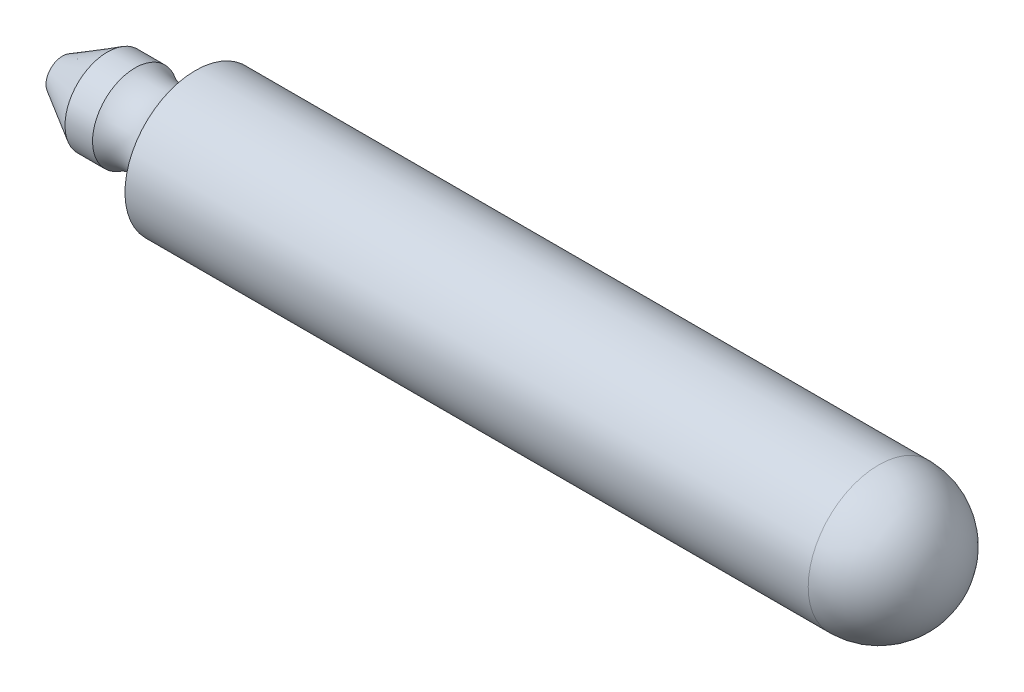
from build123d import *


with BuildPart() as part:
    # Sketch1 → Revolve1 (revolve)
    with BuildSketch(Plane.XY):
        with BuildLine():
            Line((0, 0), (-15.748, 0))
            Line((-15.748, 0), (-15.748, 0.318))
            Line((-15.748, 0.318), (-14.880242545, 0.819))
            Line((-14.880242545, 0.819), (-14.348605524, 0.819))
            ThreePointArc((-14.348605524, 0.819), (-13.617828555, 0.76959342), (-13.183, 1.359))
            Line((-13.183, 1.359), (0, 1.359))
            ThreePointArc((0, 1.359), (0.960958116, 0.960958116), (1.359, 0))
            Line((1.359, 0), (0, 0))
        make_face()
    revolve(axis=Axis((0, 0, 0), (-1, 0, 0)))


solid = part.part
